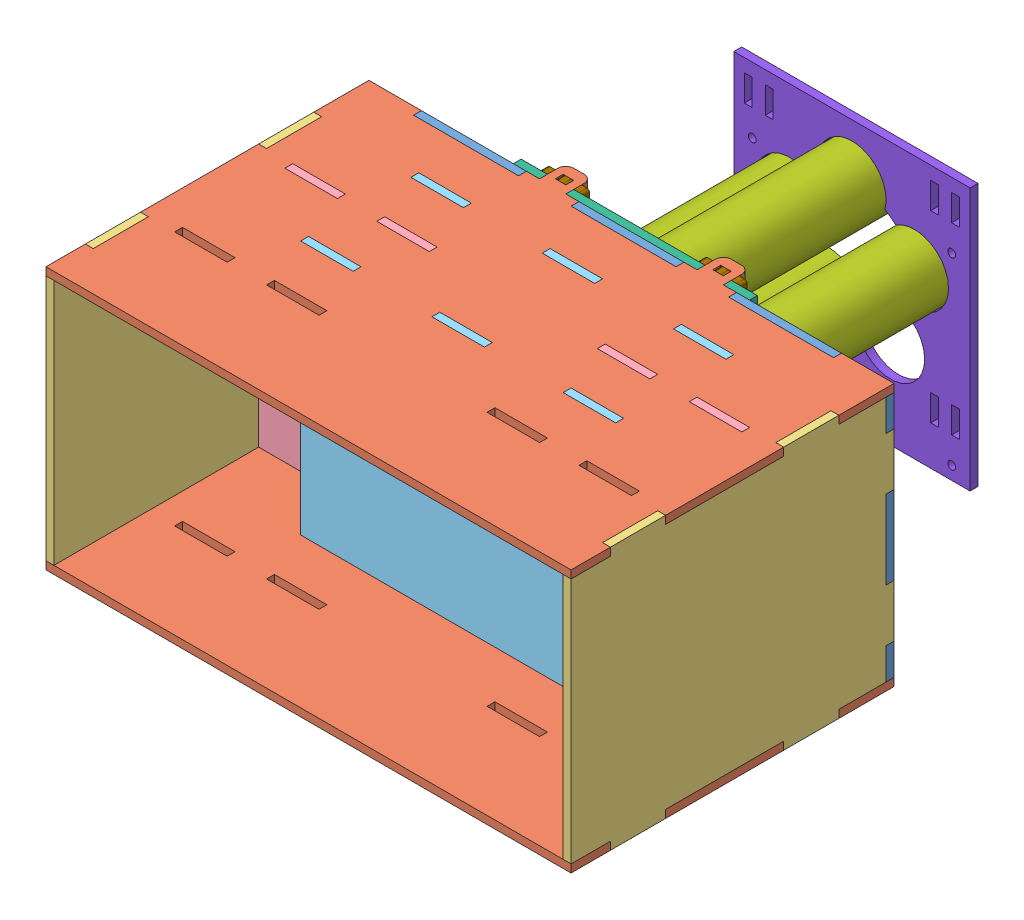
SolidWorks assembly 分隔弹仓及预排弹管.SLDASM, configuration Default (file format 11000). Lengths in mm.
Overall size (200 105 213).
20 component instances, 9 part files, 39 mates.
Components (placement in the parent):
- 弹仓底板-1: 弹仓底板.SLDPRT [默认] at (66.9746 116.0911 148.1073) size (200 100 3)
- 弹仓前后板-1: 弹仓前后板.SLDPRT [Default] at (66.9746 69.0911 211.1073) x (0 -1 0) z (-1 0 0) size (3 133 200)
- 弹仓侧板-1: 弹仓侧板.SLDPRT [Default] at (163.9746 116.0911 211.1073) x (1 0 0) z (0 -1 0) size (3 123 100)
- 弹仓侧板-2: 弹仓侧板.SLDPRT [Default] at (-33.0254 116.0911 211.1073) x (1 0 0) z (0 -1 0) size (3 123 100)
- 弹仓隔板外-1: 弹仓隔板外.SLDPRT [Default] at (32.048 106.8135 190.1073) x (0 0 1) z (-1 0 0) size (3 100 65)
- 弹仓隔板外-2: 弹仓隔板外.SLDPRT [Default] at (101.9013 125.3687 190.1073) x (0 0 1) z (1 0 0) size (3 100 65)
- 弹仓隔板中-1: 弹仓隔板中.SLDPRT [Default] at (71.4394 136.1173 169.1073) x (0 0 1) z (-1 0 0) size (3 100 120)
- 弹仓隔板中-2: 弹仓隔板中.SLDPRT [Default] at (71.4394 136.1173 211.1073) x (0 0 1) z (-1 0 0) size (3 100 120)
- 弹仓前后板-2: 弹仓前后板.SLDPRT [Default] at (66.9746 166.0911 211.1073) x (0 -1 0) z (-1 0 0) size (3 133 200)
- 预排弹管装配-1: 预排弹管装配.SLDASM [Default] at (65.8932 197.82 73.5852) x (1 0 0) z (0 -1 0) size (90 90 105)
  - 预排弹管上板-1: 预排弹管上板.SLDPRT [Default] at (1.0814 71.5221 81.7289) size (90 3 100)
  - 预排弹管-PVC25外径-1: 预排弹管-PVC25外径.SLDPRT [Default] at (-22.695 -15.4779 74.0035) size (25.2 90 25.2)
  - 预排弹管-PVC25外径-2: 预排弹管-PVC25外径.SLDPRT [Default] at (1.0814 -15.4779 56.7289) size (25.2 90 25.2)
  - 预排弹管-PVC25外径-3: 预排弹管-PVC25外径.SLDPRT [Default] at (-13.6132 -15.4779 101.9544) size (25.2 90 25.2)
  - 预排弹管-PVC25外径-4: 预排弹管-PVC25外径.SLDPRT [Default] at (24.8578 -15.4779 74.0035) size (25.2 90 25.2)
  - 预排弹安装下板-1: 预排弹安装下板.SLDPRT [默认] at (1.0814 -9.4779 81.7289) x (-1 0 0) z (0 -1 0) size (90 100 3)
- 山形固定销-1: 山形固定销.SLDPRT [Default] at (44.9746 66.0911 142.1073) x (-1 0 0) z (0 1 0) size (16 3 6)
- 山形固定销-2: 山形固定销.SLDPRT [Default] at (88.9746 166.0911 142.1073) x (1 0 0) z (0 -1 0) size (16 3 6)
- 山形固定销-3: 山形固定销.SLDPRT [Default] at (104.9746 66.0911 142.1073) x (-1 0 0) z (0 1 0) size (16 3 6)
- 山形固定销-4: 山形固定销.SLDPRT [Default] at (28.9746 166.0911 142.1073) x (1 0 0) z (0 -1 0) size (16 3 6)
Mates (geometry in assembly coordinates):
- 重合1: coincident: plane of assembly; plane of assembly; plane of 弹仓底板-1 through (86.9746 69.0911 141.1073) normal (0 -1 0); plane of 弹仓前后板-1 through (66.9746 69.0911 211.1073) normal (0 1 0)
- 重合2: coincident: plane of assembly; plane of assembly; plane of 弹仓底板-1 through (66.9746 116.0911 151.1073) normal (0 0 1); plane of 弹仓前后板-1 through (166.9746 66.0911 151.1073) normal (0 0 -1)
- 重合3: coincident: plane of assembly; plane of assembly; plane of 弹仓底板-1 through (26.9746 66.0911 141.1073) normal (1 0 0); plane of 弹仓前后板-1 through (26.9746 69.0911 151.1073) normal (-1 0 0)
- 重合4: coincident: plane of assembly; plane of assembly; plane of 弹仓底板-1 through (66.9746 116.0911 151.1073) normal (0 0 1); plane of 弹仓侧板-1 through (166.9746 66.0911 151.1073) normal (0 0 -1)
- 重合5: coincident: plane of assembly; plane of assembly; plane of 弹仓底板-1 through (166.9746 166.0911 151.1073) normal (1 0 0); plane of 弹仓侧板-1 through (166.9746 116.0911 211.1073) normal (1 0 0)
- 重合6: coincident: plane of assembly; plane of assembly; plane of 弹仓底板-1 through (146.9746 163.0911 141.1073) normal (0 1 0); plane of 弹仓侧板-1 through (163.9746 163.0911 169.1073) normal (0 1 0)
- 重合7: coincident: plane of assembly; plane of assembly; plane of 弹仓底板-1 through (66.9746 116.0911 151.1073) normal (0 0 1); plane of 弹仓侧板-2 through (-30.0254 66.0911 151.1073) normal (0 0 -1)
- 重合8: coincident: plane of assembly; plane of assembly; plane of 弹仓底板-1 through (-33.0254 66.0911 151.1073) normal (-1 0 0); plane of 弹仓侧板-2 through (-33.0254 116.0911 211.1073) normal (-1 0 0)
- 重合9: coincident: plane of assembly; plane of assembly; plane of 弹仓底板-1 through (-33.0254 151.0911 141.1073) normal (0 -1 0); plane of 弹仓侧板-2 through (-33.0254 151.0911 148.1073) normal (0 1 0)
- 重合10: coincident: plane of assembly; plane of assembly; plane of 弹仓前后板-1 through (118.9746 69.0911 190.1073) normal (0 0 1); plane of 弹仓隔板外-1 through (32.048 106.8135 190.1073) normal (0 0 -1)
- 重合11: coincident: plane of assembly; plane of assembly; plane of 弹仓前后板-1 through (34.9746 69.0911 190.1073) normal (-1 0 0); plane of 弹仓隔板外-1 through (34.9746 66.0911 193.1073) normal (1 0 0)
- 重合12: coincident: plane of assembly; plane of assembly; plane of 弹仓前后板-1 through (66.9746 66.0911 211.1073) normal (0 -1 0); plane of 弹仓隔板外-1 through (-30.0254 66.0911 193.1073) normal (0 -1 0)
- 重合13: coincident: plane of assembly; plane of assembly; plane of 弹仓前后板-1 through (118.9746 69.0911 190.1073) normal (0 0 1); plane of 弹仓隔板外-2 through (101.9013 125.3687 190.1073) normal (0 0 -1)
- 重合14: coincident: plane of assembly; plane of assembly; plane of 弹仓侧板-1 through (163.9746 116.0911 211.1073) normal (-1 0 0); plane of 弹仓隔板外-2 through (163.9746 66.0911 193.1073) normal (1 0 0)
- 重合15: coincident: plane of assembly; plane of assembly; plane of 弹仓前后板-1 through (66.9746 66.0911 211.1073) normal (0 -1 0); plane of 弹仓隔板外-2 through (98.9746 66.0911 193.1073) normal (0 -1 0)
- 重合16: coincident: plane of assembly; plane of assembly; plane of 弹仓前后板-1 through (106.9746 69.0911 169.1073) normal (0 0 1); plane of 弹仓隔板中-1 through (71.4394 136.1173 169.1073) normal (0 0 -1)
- 重合17: coincident: plane of assembly; plane of assembly; plane of 弹仓前后板-1 through (6.9746 69.0911 169.1073) normal (1 0 0); plane of 弹仓隔板中-1 through (6.9746 163.0911 172.1073) normal (-1 0 0)
- 重合18: coincident: plane of assembly; plane of assembly; plane of 弹仓前后板-1 through (66.9746 66.0911 211.1073) normal (0 -1 0); plane of 弹仓隔板中-1 through (6.9746 66.0911 169.1073) normal (0 -1 0)
- 重合19: coincident: plane of assembly; plane of assembly; plane of 弹仓前后板-1 through (26.9746 69.0911 211.1073) normal (0 0 1); plane of 弹仓隔板中-2 through (71.4394 136.1173 211.1073) normal (0 0 -1)
- 重合20: coincident: plane of assembly; plane of assembly; plane of 弹仓前后板-1 through (66.9746 66.0911 211.1073) normal (0 -1 0); plane of 弹仓隔板中-2 through (56.9746 66.0911 211.1073) normal (0 -1 0)
- 重合21: coincident: plane of assembly; plane of assembly; plane of 弹仓前后板-1 through (6.9746 69.0911 211.1073) normal (1 0 0); plane of 弹仓隔板中-2 through (6.9746 163.0911 214.1073) normal (-1 0 0)
- 重合22: coincident: plane of assembly; plane of assembly; plane of 弹仓侧板-2 through (-33.0254 163.0911 235.1073) normal (0 1 0); plane of 弹仓前后板-2 through (66.9746 163.0911 211.1073) normal (0 -1 0)
- 重合23: coincident: plane of assembly; plane of assembly; plane of 弹仓底板-1 through (66.9746 116.0911 151.1073) normal (0 0 1); plane of 弹仓前后板-2 through (166.9746 163.0911 151.1073) normal (0 0 -1)
- 重合24: coincident: plane of assembly; plane of assembly; plane of 弹仓底板-1 through (106.9746 163.0911 141.1073) normal (-1 0 0); plane of 弹仓前后板-2 through (106.9746 166.0911 148.1073) normal (1 0 0)
- 重合25: coincident: plane of assembly; plane of assembly; plane of 弹仓底板-1 through (66.9746 116.0911 148.1073) normal (0 0 -1); plane of 预排弹管装配-1/预排弹管上板-1 through (66.9746 116.0911 148.1073) normal (0 0 1)
- 重合26: coincident: plane of assembly; plane of assembly; plane of 弹仓底板-1 through (166.9746 66.0911 151.1073) normal (0 -1 0); plane of 预排弹管装配-1/预排弹管上板-1 through (21.9746 66.0911 148.1073) normal (0 -1 0)
- 重合27: coincident: plane of assembly; plane of assembly; plane of 弹仓前后板-1 through (41.9746 69.0911 138.1073) normal (1 0 0); plane of 预排弹管装配-1/预排弹管上板-1 through (41.9746 69.0911 145.1073) normal (-1 0 0)
- 重合28: coincident: plane of assembly; plane of assembly; plane of 预排弹管装配-1/预排弹管上板-1 through (66.9746 116.0911 145.1073) normal (0 0 -1); plane of 山形固定销-2 through (88.9746 166.0911 145.1073) normal (0 0 1)
- 重合29: coincident: plane of assembly; plane of assembly; plane of 预排弹管装配-1/预排弹管上板-1 through (111.9746 166.0911 148.1073) normal (0 1 0); plane of 山形固定销-2 through (98.9746 166.0911 145.1073) normal (0 1 0)
- 重合30: coincident: plane of assembly; plane of assembly; plane of 弹仓前后板-2 through (94.9746 166.0911 145.1073) normal (1 0 0); plane of 山形固定销-2 through (94.9746 166.0911 145.1073) normal (-1 0 0)
- 重合31: coincident: plane of 预排弹管装配-1/预排弹管上板-1 through (66.9746 116.0911 145.1073) normal (0 0 -1); plane of ? through (28.0879 166.0911 145.1073) normal (0 0 1)
- 重合32: coincident: plane of assembly; plane of assembly; plane of 预排弹管装配-1/预排弹管上板-1 through (66.9746 116.0911 145.1073) normal (0 0 -1); plane of 山形固定销-1 through (44.9746 66.0911 145.1073) normal (0 0 1)
- 重合33: coincident: plane of assembly; plane of assembly; plane of 预排弹管装配-1/预排弹管上板-1 through (66.9746 116.0911 145.1073) normal (0 0 -1); plane of 山形固定销-3 through (104.9746 66.0911 145.1073) normal (0 0 1)
- 重合34: coincident: plane of assembly; plane of assembly; plane of 弹仓前后板-1 through (66.9746 66.0911 211.1073) normal (0 -1 0); plane of 山形固定销-3 through (94.9746 66.0911 145.1073) normal (0 -1 0)
- 重合35: coincident: plane of assembly; plane of assembly; plane of 弹仓前后板-1 through (98.9746 69.0911 142.1073) normal (-1 0 0); plane of 山形固定销-3 through (98.9746 66.0911 145.1073) normal (1 0 0)
- 重合36: coincident: plane of assembly; plane of assembly; plane of 弹仓前后板-1 through (66.9746 66.0911 211.1073) normal (0 -1 0); plane of 山形固定销-1 through (34.9746 66.0911 145.1073) normal (0 -1 0)
- 重合37: coincident: plane of assembly; plane of assembly; plane of 弹仓前后板-1 through (31.9746 69.0911 148.1073) normal (-1 0 0); plane of 山形固定销-1 through (31.9746 66.0911 145.1073) normal (1 0 0)
- 重合38: coincident: plane of 弹仓前后板-2 through (66.9746 166.0911 211.1073) normal (0 1 0); plane of ? through (38.0879 166.0911 145.1073) normal (0 1 0)
- 重合39: coincident: plane of assembly; plane of assembly; plane of 弹仓前后板-2 through (38.9746 166.0911 142.1073) normal (-1 0 0); plane of 山形固定销-4 through (38.9746 163.0911 145.1073) normal (1 0 0)
